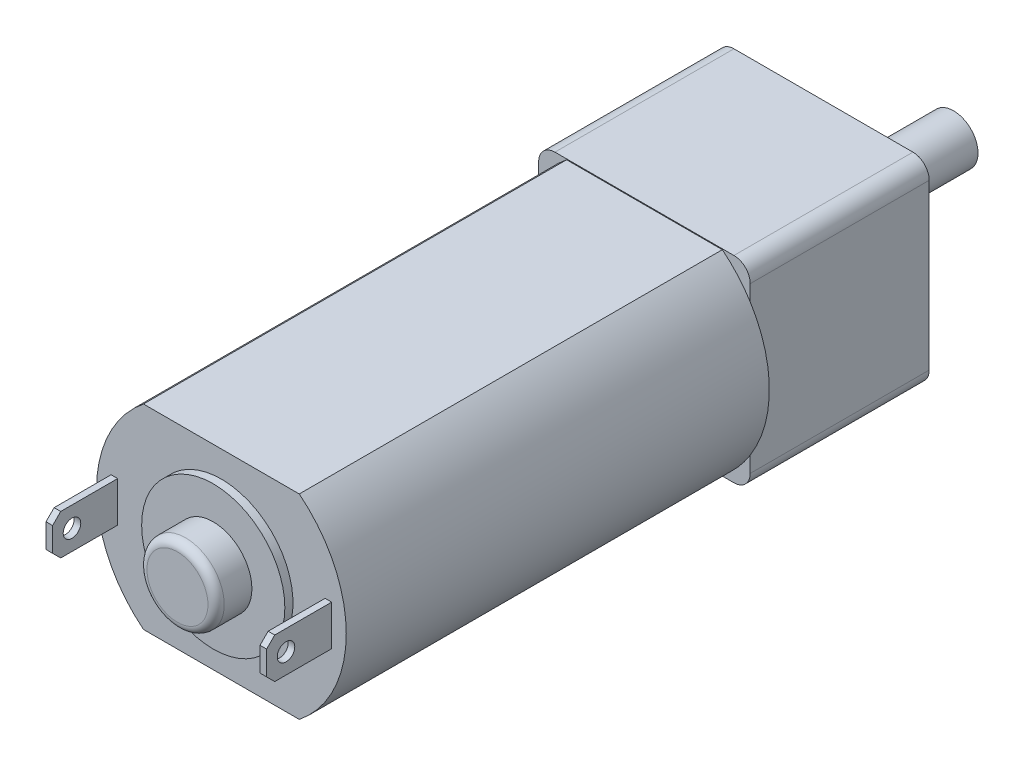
ISO-10303-21;
HEADER;
FILE_DESCRIPTION(('STEP AP214'),'2;1');
FILE_NAME('part.step','',(''),(''),'','','');
FILE_SCHEMA(('AUTOMOTIVE_DESIGN { 1 0 10303 214 1 1 1 1 }'));
ENDSEC;
DATA;
#1=APPLICATION_CONTEXT('core data for automotive mechanical design processes');
#2=APPLICATION_PROTOCOL_DEFINITION('international standard','automotive_design',2000,#1);
#3=PRODUCT_CONTEXT('',#1,'mechanical');
#4=PRODUCT('Part','Part','',(#3));
#5=PRODUCT_RELATED_PRODUCT_CATEGORY('part','',(#4));
#6=PRODUCT_DEFINITION_FORMATION('','',#4);
#7=PRODUCT_DEFINITION_CONTEXT('part definition',#1,'design');
#8=PRODUCT_DEFINITION('design','',#6,#7);
#9=PRODUCT_DEFINITION_SHAPE('','',#8);
#10=(LENGTH_UNIT() NAMED_UNIT(*) SI_UNIT(.MILLI.,.METRE.));
#11=(NAMED_UNIT(*) PLANE_ANGLE_UNIT() SI_UNIT($,.RADIAN.));
#12=(NAMED_UNIT(*) SI_UNIT($,.STERADIAN.) SOLID_ANGLE_UNIT());
#13=UNCERTAINTY_MEASURE_WITH_UNIT(LENGTH_MEASURE(1.E-05),#10,'distance_accuracy_value','');
#14=(GEOMETRIC_REPRESENTATION_CONTEXT(3) GLOBAL_UNCERTAINTY_ASSIGNED_CONTEXT((#13)) GLOBAL_UNIT_ASSIGNED_CONTEXT((#10,
#11,#12)) REPRESENTATION_CONTEXT('',''));
#15=CARTESIAN_POINT('',(0.,0.,0.));
#16=DIRECTION('',(0.,0.,1.));
#17=DIRECTION('',(1.,0.,0.));
#18=AXIS2_PLACEMENT_3D('',#15,#16,#17);
#19=CARTESIAN_POINT('',(2.39068966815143,-1.04902557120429,-22.7));
#20=DIRECTION('',(0.,1.,0.));
#21=DIRECTION('',(0.707106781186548,0.,0.707106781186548));
#22=AXIS2_PLACEMENT_3D('',#19,#20,#21);
#23=PLANE('',#22);
#24=DIRECTION('',(-1.,0.,0.));
#25=VECTOR('',#24,1.);
#26=CARTESIAN_POINT('',(2.39068966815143,-1.04902557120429,-19.));
#27=LINE('',#26,#25);
#28=CARTESIAN_POINT('',(1.07216852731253,-1.04902557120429,-19.));
#29=VERTEX_POINT('',#28);
#30=CARTESIAN_POINT('',(-1.07216852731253,-1.04902557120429,-19.));
#31=VERTEX_POINT('',#30);
#32=EDGE_CURVE('E63',#29,#31,#27,.T.);
#33=ORIENTED_EDGE('',*,*,#32,.F.);
#34=DIRECTION('',(0.,0.,-1.));
#35=VECTOR('',#34,1.);
#36=CARTESIAN_POINT('',(1.07216852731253,-1.04902557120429,-11.2));
#37=LINE('',#36,#35);
#38=CARTESIAN_POINT('',(1.07216852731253,-1.04902557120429,-12.7));
#39=VERTEX_POINT('',#38);
#40=EDGE_CURVE('E300',#39,#29,#37,.T.);
#41=ORIENTED_EDGE('',*,*,#40,.F.);
#42=DIRECTION('',(-1.,0.,0.));
#43=VECTOR('',#42,1.);
#44=CARTESIAN_POINT('',(-1.76680007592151,-1.04902557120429,-12.7));
#45=LINE('',#44,#43);
#46=CARTESIAN_POINT('',(-1.07216852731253,-1.04902557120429,-12.7));
#47=VERTEX_POINT('',#46);
#48=EDGE_CURVE('E559',#39,#47,#45,.T.);
#49=ORIENTED_EDGE('',*,*,#48,.T.);
#50=DIRECTION('',(0.,0.,1.));
#51=VECTOR('',#50,1.);
#52=CARTESIAN_POINT('',(-1.07216852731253,-1.04902557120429,-11.2));
#53=LINE('',#52,#51);
#54=EDGE_CURVE('E301',#31,#47,#53,.T.);
#55=ORIENTED_EDGE('',*,*,#54,.F.);
#56=EDGE_LOOP('',(#33,#41,#49,#55));
#57=FACE_BOUND('',#56,.T.);
#58=ADVANCED_FACE('F49',(#57),#23,.F.);
#59=CARTESIAN_POINT('',(0.,0.,-11.2));
#60=DIRECTION('',(0.,0.,-1.));
#61=DIRECTION('',(1.,0.,0.));
#62=AXIS2_PLACEMENT_3D('',#59,#60,#61);
#63=CYLINDRICAL_SURFACE('',#62,1.5);
#64=CARTESIAN_POINT('',(0.,0.,-11.2));
#65=DIRECTION('',(0.,0.,1.));
#66=DIRECTION('',(1.,0.,0.));
#67=AXIS2_PLACEMENT_3D('',#64,#65,#66);
#68=CIRCLE('',#67,1.5);
#69=CARTESIAN_POINT('',(-1.5,0.,-11.2));
#70=VERTEX_POINT('',#69);
#71=EDGE_CURVE('E308',#70,#70,#68,.T.);
#72=ORIENTED_EDGE('',*,*,#71,.F.);
#73=EDGE_LOOP('',(#72));
#74=FACE_BOUND('',#73,.T.);
#75=ORIENTED_EDGE('',*,*,#40,.T.);
#76=CARTESIAN_POINT('',(0.,0.,-19.));
#77=DIRECTION('',(0.,0.,-1.));
#78=DIRECTION('',(-1.,0.,0.));
#79=AXIS2_PLACEMENT_3D('',#76,#77,#78);
#80=CIRCLE('',#79,1.5);
#81=EDGE_CURVE('E11',#29,#31,#80,.F.);
#82=ORIENTED_EDGE('',*,*,#81,.T.);
#83=ORIENTED_EDGE('',*,*,#54,.T.);
#84=CARTESIAN_POINT('',(0.,0.,-12.7));
#85=DIRECTION('',(0.,0.,1.));
#86=DIRECTION('',(1.,0.,0.));
#87=AXIS2_PLACEMENT_3D('',#84,#85,#86);
#88=CIRCLE('',#87,1.5);
#89=EDGE_CURVE('E306',#47,#39,#88,.T.);
#90=ORIENTED_EDGE('',*,*,#89,.T.);
#91=EDGE_LOOP('',(#75,#82,#83,#90));
#92=FACE_BOUND('',#91,.T.);
#93=ADVANCED_FACE('F304',(#74,#92),#63,.T.);
#94=CARTESIAN_POINT('',(0.,0.,0.));
#95=DIRECTION('',(0.,0.,1.));
#96=DIRECTION('',(1.,0.,0.));
#97=AXIS2_PLACEMENT_3D('',#94,#95,#96);
#98=CYLINDRICAL_SURFACE('',#97,7.675);
#99=DIRECTION('',(0.,0.,1.));
#100=VECTOR('',#99,1.);
#101=CARTESIAN_POINT('',(4.78598213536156,6.,0.));
#102=LINE('',#101,#100);
#103=CARTESIAN_POINT('',(4.78598213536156,6.,0.));
#104=VERTEX_POINT('',#103);
#105=CARTESIAN_POINT('',(4.78598213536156,6.,26.));
#106=VERTEX_POINT('',#105);
#107=EDGE_CURVE('E476',#104,#106,#102,.T.);
#108=ORIENTED_EDGE('',*,*,#107,.T.);
#109=CARTESIAN_POINT('',(0.,0.,26.));
#110=DIRECTION('',(0.,0.,1.));
#111=DIRECTION('',(1.,0.,0.));
#112=AXIS2_PLACEMENT_3D('',#109,#110,#111);
#113=CIRCLE('',#112,7.675);
#114=CARTESIAN_POINT('',(4.78598213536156,-6.,26.));
#115=VERTEX_POINT('',#114);
#116=EDGE_CURVE('E471',#115,#106,#113,.T.);
#117=ORIENTED_EDGE('',*,*,#116,.F.);
#118=DIRECTION('',(0.,0.,1.));
#119=VECTOR('',#118,1.);
#120=CARTESIAN_POINT('',(4.78598213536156,-6.,0.));
#121=LINE('',#120,#119);
#122=CARTESIAN_POINT('',(4.78598213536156,-6.,0.));
#123=VERTEX_POINT('',#122);
#124=EDGE_CURVE('E70',#123,#115,#121,.T.);
#125=ORIENTED_EDGE('',*,*,#124,.F.);
#126=CARTESIAN_POINT('',(0.,0.,0.));
#127=DIRECTION('',(0.,0.,1.));
#128=DIRECTION('',(1.,0.,0.));
#129=AXIS2_PLACEMENT_3D('',#126,#127,#128);
#130=CIRCLE('',#129,7.675);
#131=CARTESIAN_POINT('',(6.5,-4.08113035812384,0.));
#132=VERTEX_POINT('',#131);
#133=EDGE_CURVE('E452',#123,#132,#130,.T.);
#134=ORIENTED_EDGE('',*,*,#133,.T.);
#135=CARTESIAN_POINT('',(6.5,4.08113035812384,0.));
#136=VERTEX_POINT('',#135);
#137=EDGE_CURVE('E458',#132,#136,#130,.T.);
#138=ORIENTED_EDGE('',*,*,#137,.T.);
#139=EDGE_CURVE('E446',#136,#104,#130,.T.);
#140=ORIENTED_EDGE('',*,*,#139,.T.);
#141=EDGE_LOOP('',(#108,#117,#125,#134,#138,#140));
#142=FACE_BOUND('',#141,.T.);
#143=ADVANCED_FACE('F589',(#142),#98,.T.);
#144=DIRECTION('',(0.,0.,1.));
#145=VECTOR('',#144,1.);
#146=CARTESIAN_POINT('',(-4.78598213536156,6.,0.));
#147=LINE('',#146,#145);
#148=CARTESIAN_POINT('',(-4.78598213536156,6.,0.));
#149=VERTEX_POINT('',#148);
#150=CARTESIAN_POINT('',(-4.78598213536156,6.,26.));
#151=VERTEX_POINT('',#150);
#152=EDGE_CURVE('E1087',#149,#151,#147,.T.);
#153=ORIENTED_EDGE('',*,*,#152,.F.);
#154=CARTESIAN_POINT('',(-6.5,4.08113035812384,0.));
#155=VERTEX_POINT('',#154);
#156=EDGE_CURVE('E450',#149,#155,#130,.T.);
#157=ORIENTED_EDGE('',*,*,#156,.T.);
#158=CARTESIAN_POINT('',(-6.5,-4.08113035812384,0.));
#159=VERTEX_POINT('',#158);
#160=EDGE_CURVE('E453',#155,#159,#130,.T.);
#161=ORIENTED_EDGE('',*,*,#160,.T.);
#162=CARTESIAN_POINT('',(-4.78598213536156,-6.,0.));
#163=VERTEX_POINT('',#162);
#164=EDGE_CURVE('E461',#159,#163,#130,.T.);
#165=ORIENTED_EDGE('',*,*,#164,.T.);
#166=DIRECTION('',(0.,0.,1.));
#167=VECTOR('',#166,1.);
#168=CARTESIAN_POINT('',(-4.78598213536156,-6.,0.));
#169=LINE('',#168,#167);
#170=CARTESIAN_POINT('',(-4.78598213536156,-6.,26.));
#171=VERTEX_POINT('',#170);
#172=EDGE_CURVE('E1093',#163,#171,#169,.T.);
#173=ORIENTED_EDGE('',*,*,#172,.T.);
#174=EDGE_CURVE('E468',#151,#171,#113,.T.);
#175=ORIENTED_EDGE('',*,*,#174,.F.);
#176=EDGE_LOOP('',(#153,#157,#161,#165,#173,#175));
#177=FACE_BOUND('',#176,.T.);
#178=ADVANCED_FACE('F888',(#177),#98,.T.);
#179=CARTESIAN_POINT('',(0.,0.,26.));
#180=DIRECTION('',(0.,0.,1.));
#181=DIRECTION('',(0.707106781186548,0.707106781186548,0.));
#182=AXIS2_PLACEMENT_3D('',#179,#180,#181);
#183=PLANE('',#182);
#184=DIRECTION('',(1.,0.,0.));
#185=VECTOR('',#184,1.);
#186=CARTESIAN_POINT('',(0.,6.,26.));
#187=LINE('',#186,#185);
#188=EDGE_CURVE('E1090',#151,#106,#187,.T.);
#189=ORIENTED_EDGE('',*,*,#188,.F.);
#190=ORIENTED_EDGE('',*,*,#174,.T.);
#191=DIRECTION('',(1.,0.,0.));
#192=VECTOR('',#191,1.);
#193=CARTESIAN_POINT('',(0.,-6.,26.));
#194=LINE('',#193,#192);
#195=EDGE_CURVE('E302',#171,#115,#194,.T.);
#196=ORIENTED_EDGE('',*,*,#195,.T.);
#197=ORIENTED_EDGE('',*,*,#116,.T.);
#198=EDGE_LOOP('',(#189,#190,#196,#197));
#199=FACE_BOUND('',#198,.T.);
#200=DIRECTION('',(0.,-1.,0.));
#201=VECTOR('',#200,1.);
#202=CARTESIAN_POINT('',(6.77850761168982,0.619842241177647,26.));
#203=LINE('',#202,#201);
#204=CARTESIAN_POINT('',(6.77850761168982,1.23968448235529,26.));
#205=VERTEX_POINT('',#204);
#206=CARTESIAN_POINT('',(6.77850761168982,-1.23968448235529,26.));
#207=VERTEX_POINT('',#206);
#208=EDGE_CURVE('E362',#205,#207,#203,.T.);
#209=ORIENTED_EDGE('',*,*,#208,.T.);
#210=DIRECTION('',(-1.,0.,0.));
#211=VECTOR('',#210,1.);
#212=CARTESIAN_POINT('',(3.38925380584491,-1.23968448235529,26.));
#213=LINE('',#212,#211);
#214=CARTESIAN_POINT('',(6.37418759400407,-1.23968448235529,26.));
#215=VERTEX_POINT('',#214);
#216=EDGE_CURVE('E365',#207,#215,#213,.T.);
#217=ORIENTED_EDGE('',*,*,#216,.T.);
#218=DIRECTION('',(0.,1.,0.));
#219=VECTOR('',#218,1.);
#220=CARTESIAN_POINT('',(6.37418759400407,-0.619842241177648,26.));
#221=LINE('',#220,#219);
#222=CARTESIAN_POINT('',(6.37418759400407,1.23968448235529,26.));
#223=VERTEX_POINT('',#222);
#224=EDGE_CURVE('E346',#215,#223,#221,.T.);
#225=ORIENTED_EDGE('',*,*,#224,.T.);
#226=DIRECTION('',(1.,0.,0.));
#227=VECTOR('',#226,1.);
#228=CARTESIAN_POINT('',(3.18709379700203,1.23968448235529,26.));
#229=LINE('',#228,#227);
#230=EDGE_CURVE('E344',#223,#205,#229,.T.);
#231=ORIENTED_EDGE('',*,*,#230,.T.);
#232=EDGE_LOOP('',(#209,#217,#225,#231));
#233=FACE_BOUND('',#232,.T.);
#234=DIRECTION('',(0.,1.,0.));
#235=VECTOR('',#234,1.);
#236=CARTESIAN_POINT('',(-6.77850761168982,0.619842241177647,26.));
#237=LINE('',#236,#235);
#238=CARTESIAN_POINT('',(-6.77850761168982,-1.23968448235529,26.));
#239=VERTEX_POINT('',#238);
#240=CARTESIAN_POINT('',(-6.77850761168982,1.23968448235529,26.));
#241=VERTEX_POINT('',#240);
#242=EDGE_CURVE('E347',#239,#241,#237,.T.);
#243=ORIENTED_EDGE('',*,*,#242,.T.);
#244=DIRECTION('',(1.,0.,0.));
#245=VECTOR('',#244,1.);
#246=CARTESIAN_POINT('',(-3.18709379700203,1.23968448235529,26.));
#247=LINE('',#246,#245);
#248=CARTESIAN_POINT('',(-6.37418759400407,1.23968448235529,26.));
#249=VERTEX_POINT('',#248);
#250=EDGE_CURVE('E409',#241,#249,#247,.T.);
#251=ORIENTED_EDGE('',*,*,#250,.T.);
#252=DIRECTION('',(0.,-1.,0.));
#253=VECTOR('',#252,1.);
#254=CARTESIAN_POINT('',(-6.37418759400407,-0.619842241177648,26.));
#255=LINE('',#254,#253);
#256=CARTESIAN_POINT('',(-6.37418759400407,-1.23968448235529,26.));
#257=VERTEX_POINT('',#256);
#258=EDGE_CURVE('E436',#249,#257,#255,.T.);
#259=ORIENTED_EDGE('',*,*,#258,.T.);
#260=DIRECTION('',(-1.,0.,0.));
#261=VECTOR('',#260,1.);
#262=CARTESIAN_POINT('',(-3.38925380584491,-1.23968448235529,26.));
#263=LINE('',#262,#261);
#264=EDGE_CURVE('E440',#257,#239,#263,.T.);
#265=ORIENTED_EDGE('',*,*,#264,.T.);
#266=EDGE_LOOP('',(#243,#251,#259,#265));
#267=FACE_BOUND('',#266,.T.);
#268=CARTESIAN_POINT('',(0.,0.,26.));
#269=DIRECTION('',(0.,0.,-1.));
#270=DIRECTION('',(-1.,0.,0.));
#271=AXIS2_PLACEMENT_3D('',#268,#269,#270);
#272=CIRCLE('',#271,4.4);
#273=CARTESIAN_POINT('',(-4.4,0.,26.));
#274=VERTEX_POINT('',#273);
#275=EDGE_CURVE('E443',#274,#274,#272,.T.);
#276=ORIENTED_EDGE('',*,*,#275,.T.);
#277=EDGE_LOOP('',(#276));
#278=FACE_BOUND('',#277,.T.);
#279=ADVANCED_FACE('F51',(#199,#233,#267,#278),#183,.T.);
#280=CARTESIAN_POINT('',(0.,4.375,-5.69956969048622));
#281=DIRECTION('',(0.,0.,-1.));
#282=DIRECTION('',(-1.,0.,0.));
#283=AXIS2_PLACEMENT_3D('',#280,#281,#282);
#284=CONICAL_SURFACE('',#283,0.5,1.02974425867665);
#285=CARTESIAN_POINT('',(0.,4.375,-6.));
#286=DIRECTION('',(0.,0.,-1.));
#287=DIRECTION('',(-1.,0.,0.));
#288=AXIS2_PLACEMENT_3D('',#285,#286,#287);
#289=CIRCLE('',#288,1.);
#290=CARTESIAN_POINT('',(-1.,4.375,-6.));
#291=VERTEX_POINT('',#290);
#292=EDGE_CURVE('E57',#291,#291,#289,.T.);
#293=ORIENTED_EDGE('',*,*,#292,.T.);
#294=EDGE_LOOP('',(#293));
#295=FACE_BOUND('',#294,.T.);
#296=CARTESIAN_POINT('',(0.,4.375,-5.39913938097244));
#297=VERTEX_POINT('',#296);
#298=VERTEX_LOOP('',#297);
#299=FACE_BOUND('',#298,.T.);
#300=ADVANCED_FACE('F806',(#295,#299),#284,.F.);
#301=CARTESIAN_POINT('',(0.,4.375,-8.5));
#302=DIRECTION('',(0.,0.,-1.));
#303=DIRECTION('',(-1.,0.,0.));
#304=AXIS2_PLACEMENT_3D('',#301,#302,#303);
#305=CYLINDRICAL_SURFACE('',#304,1.);
#306=CARTESIAN_POINT('',(0.,4.375,-11.));
#307=DIRECTION('',(0.,0.,1.));
#308=DIRECTION('',(-1.,0.,0.));
#309=AXIS2_PLACEMENT_3D('',#306,#307,#308);
#310=CIRCLE('',#309,1.);
#311=CARTESIAN_POINT('',(-1.,4.375,-11.));
#312=VERTEX_POINT('',#311);
#313=EDGE_CURVE('E481',#312,#312,#310,.T.);
#314=ORIENTED_EDGE('',*,*,#313,.F.);
#315=EDGE_LOOP('',(#314));
#316=FACE_BOUND('',#315,.T.);
#317=ORIENTED_EDGE('',*,*,#292,.F.);
#318=EDGE_LOOP('',(#317));
#319=FACE_BOUND('',#318,.T.);
#320=ADVANCED_FACE('F800',(#316,#319),#305,.F.);
#321=CARTESIAN_POINT('',(0.,-4.375,-5.69956969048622));
#322=DIRECTION('',(0.,0.,-1.));
#323=DIRECTION('',(-1.,0.,0.));
#324=AXIS2_PLACEMENT_3D('',#321,#322,#323);
#325=CONICAL_SURFACE('',#324,0.5,1.02974425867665);
#326=CARTESIAN_POINT('',(0.,-4.375,-6.));
#327=DIRECTION('',(0.,0.,-1.));
#328=DIRECTION('',(-1.,0.,0.));
#329=AXIS2_PLACEMENT_3D('',#326,#327,#328);
#330=CIRCLE('',#329,1.);
#331=CARTESIAN_POINT('',(-1.,-4.375,-6.));
#332=VERTEX_POINT('',#331);
#333=EDGE_CURVE('E480',#332,#332,#330,.T.);
#334=ORIENTED_EDGE('',*,*,#333,.T.);
#335=EDGE_LOOP('',(#334));
#336=FACE_BOUND('',#335,.T.);
#337=CARTESIAN_POINT('',(0.,-4.375,-5.39913938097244));
#338=VERTEX_POINT('',#337);
#339=VERTEX_LOOP('',#338);
#340=FACE_BOUND('',#339,.T.);
#341=ADVANCED_FACE('F791',(#336,#340),#325,.F.);
#342=CARTESIAN_POINT('',(0.,-4.375,-8.5));
#343=DIRECTION('',(0.,0.,-1.));
#344=DIRECTION('',(-1.,0.,0.));
#345=AXIS2_PLACEMENT_3D('',#342,#343,#344);
#346=CYLINDRICAL_SURFACE('',#345,1.);
#347=CARTESIAN_POINT('',(0.,-4.375,-11.));
#348=DIRECTION('',(0.,0.,1.));
#349=DIRECTION('',(-1.,0.,0.));
#350=AXIS2_PLACEMENT_3D('',#347,#348,#349);
#351=CIRCLE('',#350,1.);
#352=CARTESIAN_POINT('',(-1.,-4.375,-11.));
#353=VERTEX_POINT('',#352);
#354=EDGE_CURVE('E485',#353,#353,#351,.T.);
#355=ORIENTED_EDGE('',*,*,#354,.F.);
#356=EDGE_LOOP('',(#355));
#357=FACE_BOUND('',#356,.T.);
#358=ORIENTED_EDGE('',*,*,#333,.F.);
#359=EDGE_LOOP('',(#358));
#360=FACE_BOUND('',#359,.T.);
#361=ADVANCED_FACE('F779',(#357,#360),#346,.F.);
#362=CARTESIAN_POINT('',(4.5,4.05,-11.));
#363=DIRECTION('',(0.,0.,1.));
#364=DIRECTION('',(1.,0.,0.));
#365=AXIS2_PLACEMENT_3D('',#362,#363,#364);
#366=CYLINDRICAL_SURFACE('',#365,1.15);
#367=CARTESIAN_POINT('',(4.5,4.05,-10.9));
#368=DIRECTION('',(0.,0.,1.));
#369=DIRECTION('',(1.,0.,0.));
#370=AXIS2_PLACEMENT_3D('',#367,#368,#369);
#371=CIRCLE('',#370,1.15);
#372=CARTESIAN_POINT('',(3.35,4.05,-10.9));
#373=VERTEX_POINT('',#372);
#374=EDGE_CURVE('E488',#373,#373,#371,.T.);
#375=ORIENTED_EDGE('',*,*,#374,.T.);
#376=EDGE_LOOP('',(#375));
#377=FACE_BOUND('',#376,.T.);
#378=CARTESIAN_POINT('',(4.5,4.05,-11.));
#379=DIRECTION('',(0.,0.,1.));
#380=DIRECTION('',(1.,0.,0.));
#381=AXIS2_PLACEMENT_3D('',#378,#379,#380);
#382=CIRCLE('',#381,1.15);
#383=CARTESIAN_POINT('',(3.35,4.05,-11.));
#384=VERTEX_POINT('',#383);
#385=EDGE_CURVE('E491',#384,#384,#382,.T.);
#386=ORIENTED_EDGE('',*,*,#385,.F.);
#387=EDGE_LOOP('',(#386));
#388=FACE_BOUND('',#387,.T.);
#389=ADVANCED_FACE('F773',(#377,#388),#366,.F.);
#390=CARTESIAN_POINT('',(4.5,4.05,-10.9));
#391=DIRECTION('',(0.,0.,1.));
#392=DIRECTION('',(0.707106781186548,0.707106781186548,0.));
#393=AXIS2_PLACEMENT_3D('',#390,#391,#392);
#394=PLANE('',#393);
#395=ORIENTED_EDGE('',*,*,#374,.F.);
#396=EDGE_LOOP('',(#395));
#397=FACE_BOUND('',#396,.T.);
#398=ADVANCED_FACE('F762',(#397),#394,.F.);
#399=CARTESIAN_POINT('',(-4.5,-4.05,-11.));
#400=DIRECTION('',(0.,0.,1.));
#401=DIRECTION('',(1.,0.,0.));
#402=AXIS2_PLACEMENT_3D('',#399,#400,#401);
#403=CYLINDRICAL_SURFACE('',#402,1.15);
#404=CARTESIAN_POINT('',(-4.5,-4.05,-10.9));
#405=DIRECTION('',(0.,0.,1.));
#406=DIRECTION('',(1.,0.,0.));
#407=AXIS2_PLACEMENT_3D('',#404,#405,#406);
#408=CIRCLE('',#407,1.15);
#409=CARTESIAN_POINT('',(-5.65,-4.05,-10.9));
#410=VERTEX_POINT('',#409);
#411=EDGE_CURVE('E494',#410,#410,#408,.T.);
#412=ORIENTED_EDGE('',*,*,#411,.T.);
#413=EDGE_LOOP('',(#412));
#414=FACE_BOUND('',#413,.T.);
#415=CARTESIAN_POINT('',(-4.5,-4.05,-11.));
#416=DIRECTION('',(0.,0.,1.));
#417=DIRECTION('',(1.,0.,0.));
#418=AXIS2_PLACEMENT_3D('',#415,#416,#417);
#419=CIRCLE('',#418,1.15);
#420=CARTESIAN_POINT('',(-5.65,-4.05,-11.));
#421=VERTEX_POINT('',#420);
#422=EDGE_CURVE('E497',#421,#421,#419,.T.);
#423=ORIENTED_EDGE('',*,*,#422,.F.);
#424=EDGE_LOOP('',(#423));
#425=FACE_BOUND('',#424,.T.);
#426=ADVANCED_FACE('F755',(#414,#425),#403,.F.);
#427=CARTESIAN_POINT('',(-4.5,-4.05,-10.9));
#428=DIRECTION('',(0.,0.,1.));
#429=DIRECTION('',(0.707106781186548,0.707106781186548,0.));
#430=AXIS2_PLACEMENT_3D('',#427,#428,#429);
#431=PLANE('',#430);
#432=ORIENTED_EDGE('',*,*,#411,.F.);
#433=EDGE_LOOP('',(#432));
#434=FACE_BOUND('',#433,.T.);
#435=ADVANCED_FACE('F761',(#434),#431,.F.);
#436=CARTESIAN_POINT('',(5.5,-5.05,0.));
#437=DIRECTION('',(0.,0.,-1.));
#438=DIRECTION('',(0.707106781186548,-0.707106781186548,0.));
#439=AXIS2_PLACEMENT_3D('',#436,#437,#438);
#440=CYLINDRICAL_SURFACE('',#439,1.);
#441=CARTESIAN_POINT('',(5.5,-5.05,-11.));
#442=DIRECTION('',(0.,0.,1.));
#443=DIRECTION('',(0.707106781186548,-0.707106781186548,0.));
#444=AXIS2_PLACEMENT_3D('',#441,#442,#443);
#445=CIRCLE('',#444,1.);
#446=CARTESIAN_POINT('',(5.5,-6.05,-11.));
#447=VERTEX_POINT('',#446);
#448=CARTESIAN_POINT('',(6.5,-5.05,-11.));
#449=VERTEX_POINT('',#448);
#450=EDGE_CURVE('E500',#447,#449,#445,.T.);
#451=ORIENTED_EDGE('',*,*,#450,.T.);
#452=DIRECTION('',(0.,0.,1.));
#453=VECTOR('',#452,1.);
#454=CARTESIAN_POINT('',(6.5,-5.05,0.));
#455=LINE('',#454,#453);
#456=CARTESIAN_POINT('',(6.5,-5.05,0.));
#457=VERTEX_POINT('',#456);
#458=EDGE_CURVE('E506',#449,#457,#455,.T.);
#459=ORIENTED_EDGE('',*,*,#458,.T.);
#460=CARTESIAN_POINT('',(5.5,-5.05,0.));
#461=DIRECTION('',(0.,0.,-1.));
#462=DIRECTION('',(0.707106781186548,-0.707106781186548,0.));
#463=AXIS2_PLACEMENT_3D('',#460,#461,#462);
#464=CIRCLE('',#463,1.);
#465=CARTESIAN_POINT('',(5.5,-6.05,0.));
#466=VERTEX_POINT('',#465);
#467=EDGE_CURVE('E509',#457,#466,#464,.T.);
#468=ORIENTED_EDGE('',*,*,#467,.T.);
#469=DIRECTION('',(0.,0.,-1.));
#470=VECTOR('',#469,1.);
#471=CARTESIAN_POINT('',(5.5,-6.05,0.));
#472=LINE('',#471,#470);
#473=EDGE_CURVE('E512',#466,#447,#472,.T.);
#474=ORIENTED_EDGE('',*,*,#473,.T.);
#475=EDGE_LOOP('',(#451,#459,#468,#474));
#476=FACE_BOUND('',#475,.T.);
#477=ADVANCED_FACE('F847',(#476),#440,.T.);
#478=CARTESIAN_POINT('',(6.5,-6.05,0.));
#479=DIRECTION('',(0.,-1.,0.));
#480=DIRECTION('',(0.707106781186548,0.,0.707106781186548));
#481=AXIS2_PLACEMENT_3D('',#478,#479,#480);
#482=PLANE('',#481);
#483=ORIENTED_EDGE('',*,*,#473,.F.);
#484=DIRECTION('',(-1.,0.,0.));
#485=VECTOR('',#484,1.);
#486=CARTESIAN_POINT('',(6.5,-6.05,0.));
#487=LINE('',#486,#485);
#488=CARTESIAN_POINT('',(-5.5,-6.05,0.));
#489=VERTEX_POINT('',#488);
#490=EDGE_CURVE('E514',#466,#489,#487,.T.);
#491=ORIENTED_EDGE('',*,*,#490,.T.);
#492=DIRECTION('',(0.,0.,1.));
#493=VECTOR('',#492,1.);
#494=CARTESIAN_POINT('',(-5.5,-6.05,0.));
#495=LINE('',#494,#493);
#496=CARTESIAN_POINT('',(-5.5,-6.05,-11.));
#497=VERTEX_POINT('',#496);
#498=EDGE_CURVE('E517',#497,#489,#495,.T.);
#499=ORIENTED_EDGE('',*,*,#498,.F.);
#500=DIRECTION('',(-1.,0.,0.));
#501=VECTOR('',#500,1.);
#502=CARTESIAN_POINT('',(6.5,-6.05,-11.));
#503=LINE('',#502,#501);
#504=EDGE_CURVE('E503',#447,#497,#503,.T.);
#505=ORIENTED_EDGE('',*,*,#504,.F.);
#506=EDGE_LOOP('',(#483,#491,#499,#505));
#507=FACE_BOUND('',#506,.T.);
#508=ADVANCED_FACE('F958',(#507),#482,.T.);
#509=CARTESIAN_POINT('',(0.,0.,0.));
#510=DIRECTION('',(0.,0.,1.));
#511=DIRECTION('',(0.707106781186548,0.707106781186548,0.));
#512=AXIS2_PLACEMENT_3D('',#509,#510,#511);
#513=PLANE('',#512);
#514=ORIENTED_EDGE('',*,*,#133,.F.);
#515=DIRECTION('',(1.,0.,0.));
#516=VECTOR('',#515,1.);
#517=CARTESIAN_POINT('',(0.,-6.,0.));
#518=LINE('',#517,#516);
#519=EDGE_CURVE('E1091',#163,#123,#518,.T.);
#520=ORIENTED_EDGE('',*,*,#519,.F.);
#521=ORIENTED_EDGE('',*,*,#164,.F.);
#522=DIRECTION('',(0.,1.,0.));
#523=VECTOR('',#522,1.);
#524=CARTESIAN_POINT('',(-6.5,-6.05,0.));
#525=LINE('',#524,#523);
#526=CARTESIAN_POINT('',(-6.5,-5.05,0.));
#527=VERTEX_POINT('',#526);
#528=EDGE_CURVE('E527',#527,#159,#525,.T.);
#529=ORIENTED_EDGE('',*,*,#528,.F.);
#530=CARTESIAN_POINT('',(-5.5,-5.05,0.));
#531=DIRECTION('',(0.,0.,-1.));
#532=DIRECTION('',(-0.707106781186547,-0.707106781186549,0.));
#533=AXIS2_PLACEMENT_3D('',#530,#531,#532);
#534=CIRCLE('',#533,1.);
#535=EDGE_CURVE('E521',#489,#527,#534,.T.);
#536=ORIENTED_EDGE('',*,*,#535,.F.);
#537=ORIENTED_EDGE('',*,*,#490,.F.);
#538=ORIENTED_EDGE('',*,*,#467,.F.);
#539=DIRECTION('',(0.,-1.,0.));
#540=VECTOR('',#539,1.);
#541=CARTESIAN_POINT('',(6.5,6.05,0.));
#542=LINE('',#541,#540);
#543=EDGE_CURVE('E484',#132,#457,#542,.T.);
#544=ORIENTED_EDGE('',*,*,#543,.F.);
#545=EDGE_LOOP('',(#514,#520,#521,#529,#536,#537,#538,#544));
#546=FACE_BOUND('',#545,.T.);
#547=ADVANCED_FACE('F948',(#546),#513,.T.);
#548=CARTESIAN_POINT('',(5.5,5.05,0.));
#549=DIRECTION('',(0.,0.,-1.));
#550=DIRECTION('',(0.707106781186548,0.707106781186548,0.));
#551=AXIS2_PLACEMENT_3D('',#548,#549,#550);
#552=CYLINDRICAL_SURFACE('',#551,1.);
#553=CARTESIAN_POINT('',(5.5,5.05,-11.));
#554=DIRECTION('',(0.,0.,1.));
#555=DIRECTION('',(0.707106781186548,0.707106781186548,0.));
#556=AXIS2_PLACEMENT_3D('',#553,#554,#555);
#557=CIRCLE('',#556,1.);
#558=CARTESIAN_POINT('',(6.5,5.05,-11.));
#559=VERTEX_POINT('',#558);
#560=CARTESIAN_POINT('',(5.5,6.05,-11.));
#561=VERTEX_POINT('',#560);
#562=EDGE_CURVE('E516',#559,#561,#557,.T.);
#563=ORIENTED_EDGE('',*,*,#562,.T.);
#564=DIRECTION('',(0.,0.,1.));
#565=VECTOR('',#564,1.);
#566=CARTESIAN_POINT('',(5.5,6.05,0.));
#567=LINE('',#566,#565);
#568=CARTESIAN_POINT('',(5.5,6.05,0.));
#569=VERTEX_POINT('',#568);
#570=EDGE_CURVE('E536',#561,#569,#567,.T.);
#571=ORIENTED_EDGE('',*,*,#570,.T.);
#572=CARTESIAN_POINT('',(5.5,5.05,0.));
#573=DIRECTION('',(0.,0.,-1.));
#574=DIRECTION('',(0.707106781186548,0.707106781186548,0.));
#575=AXIS2_PLACEMENT_3D('',#572,#573,#574);
#576=CIRCLE('',#575,1.);
#577=CARTESIAN_POINT('',(6.5,5.05,0.));
#578=VERTEX_POINT('',#577);
#579=EDGE_CURVE('E539',#569,#578,#576,.T.);
#580=ORIENTED_EDGE('',*,*,#579,.T.);
#581=DIRECTION('',(0.,0.,-1.));
#582=VECTOR('',#581,1.);
#583=CARTESIAN_POINT('',(6.5,5.05,0.));
#584=LINE('',#583,#582);
#585=EDGE_CURVE('E542',#578,#559,#584,.T.);
#586=ORIENTED_EDGE('',*,*,#585,.T.);
#587=EDGE_LOOP('',(#563,#571,#580,#586));
#588=FACE_BOUND('',#587,.T.);
#589=ADVANCED_FACE('F942',(#588),#552,.T.);
#590=CARTESIAN_POINT('',(0.,0.,0.));
#591=DIRECTION('',(0.,0.,1.));
#592=DIRECTION('',(0.707106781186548,0.707106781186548,0.));
#593=AXIS2_PLACEMENT_3D('',#590,#591,#592);
#594=PLANE('',#593);
#595=ORIENTED_EDGE('',*,*,#156,.F.);
#596=DIRECTION('',(1.,0.,0.));
#597=VECTOR('',#596,1.);
#598=CARTESIAN_POINT('',(0.,6.,0.));
#599=LINE('',#598,#597);
#600=EDGE_CURVE('E1107',#149,#104,#599,.T.);
#601=ORIENTED_EDGE('',*,*,#600,.T.);
#602=ORIENTED_EDGE('',*,*,#139,.F.);
#603=DIRECTION('',(0.,-1.,0.));
#604=VECTOR('',#603,1.);
#605=CARTESIAN_POINT('',(6.5,6.05,0.));
#606=LINE('',#605,#604);
#607=EDGE_CURVE('E319',#578,#136,#606,.T.);
#608=ORIENTED_EDGE('',*,*,#607,.F.);
#609=ORIENTED_EDGE('',*,*,#579,.F.);
#610=DIRECTION('',(1.,0.,0.));
#611=VECTOR('',#610,1.);
#612=CARTESIAN_POINT('',(-6.5,6.05,0.));
#613=LINE('',#612,#611);
#614=CARTESIAN_POINT('',(-5.5,6.05,0.));
#615=VERTEX_POINT('',#614);
#616=EDGE_CURVE('E544',#615,#569,#613,.T.);
#617=ORIENTED_EDGE('',*,*,#616,.F.);
#618=CARTESIAN_POINT('',(-5.5,5.05,0.));
#619=DIRECTION('',(0.,0.,-1.));
#620=DIRECTION('',(-0.707106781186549,0.707106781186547,0.));
#621=AXIS2_PLACEMENT_3D('',#618,#619,#620);
#622=CIRCLE('',#621,1.);
#623=CARTESIAN_POINT('',(-6.5,5.05,0.));
#624=VERTEX_POINT('',#623);
#625=EDGE_CURVE('E546',#624,#615,#622,.T.);
#626=ORIENTED_EDGE('',*,*,#625,.F.);
#627=DIRECTION('',(0.,1.,0.));
#628=VECTOR('',#627,1.);
#629=CARTESIAN_POINT('',(-6.5,-6.05,0.));
#630=LINE('',#629,#628);
#631=EDGE_CURVE('E552',#155,#624,#630,.T.);
#632=ORIENTED_EDGE('',*,*,#631,.F.);
#633=EDGE_LOOP('',(#595,#601,#602,#608,#609,#617,#626,#632));
#634=FACE_BOUND('',#633,.T.);
#635=ADVANCED_FACE('F934',(#634),#594,.T.);
#636=CARTESIAN_POINT('',(-6.5,6.05,0.));
#637=DIRECTION('',(0.,1.,0.));
#638=DIRECTION('',(0.707106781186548,0.,0.707106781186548));
#639=AXIS2_PLACEMENT_3D('',#636,#637,#638);
#640=PLANE('',#639);
#641=ORIENTED_EDGE('',*,*,#570,.F.);
#642=DIRECTION('',(1.,0.,0.));
#643=VECTOR('',#642,1.);
#644=CARTESIAN_POINT('',(-6.5,6.05,-11.));
#645=LINE('',#644,#643);
#646=CARTESIAN_POINT('',(-5.5,6.05,-11.));
#647=VERTEX_POINT('',#646);
#648=EDGE_CURVE('E327',#647,#561,#645,.T.);
#649=ORIENTED_EDGE('',*,*,#648,.F.);
#650=DIRECTION('',(0.,0.,-1.));
#651=VECTOR('',#650,1.);
#652=CARTESIAN_POINT('',(-5.5,6.05,0.));
#653=LINE('',#652,#651);
#654=EDGE_CURVE('E549',#615,#647,#653,.T.);
#655=ORIENTED_EDGE('',*,*,#654,.F.);
#656=ORIENTED_EDGE('',*,*,#616,.T.);
#657=EDGE_LOOP('',(#641,#649,#655,#656));
#658=FACE_BOUND('',#657,.T.);
#659=ADVANCED_FACE('F921',(#658),#640,.T.);
#660=CARTESIAN_POINT('',(-5.5,-5.05,0.));
#661=DIRECTION('',(0.,0.,-1.));
#662=DIRECTION('',(-0.707106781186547,-0.707106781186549,0.));
#663=AXIS2_PLACEMENT_3D('',#660,#661,#662);
#664=CYLINDRICAL_SURFACE('',#663,1.);
#665=CARTESIAN_POINT('',(-5.5,-5.05,-11.));
#666=DIRECTION('',(0.,0.,1.));
#667=DIRECTION('',(-0.707106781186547,-0.707106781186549,0.));
#668=AXIS2_PLACEMENT_3D('',#665,#666,#667);
#669=CIRCLE('',#668,1.);
#670=CARTESIAN_POINT('',(-6.5,-5.05,-11.));
#671=VERTEX_POINT('',#670);
#672=EDGE_CURVE('E520',#671,#497,#669,.T.);
#673=ORIENTED_EDGE('',*,*,#672,.T.);
#674=ORIENTED_EDGE('',*,*,#498,.T.);
#675=ORIENTED_EDGE('',*,*,#535,.T.);
#676=DIRECTION('',(0.,0.,-1.));
#677=VECTOR('',#676,1.);
#678=CARTESIAN_POINT('',(-6.5,-5.05,0.));
#679=LINE('',#678,#677);
#680=EDGE_CURVE('E530',#527,#671,#679,.T.);
#681=ORIENTED_EDGE('',*,*,#680,.T.);
#682=EDGE_LOOP('',(#673,#674,#675,#681));
#683=FACE_BOUND('',#682,.T.);
#684=ADVANCED_FACE('F915',(#683),#664,.T.);
#685=CARTESIAN_POINT('',(-6.5,-6.05,0.));
#686=DIRECTION('',(-1.,0.,0.));
#687=DIRECTION('',(0.,0.707106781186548,0.707106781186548));
#688=AXIS2_PLACEMENT_3D('',#685,#686,#687);
#689=PLANE('',#688);
#690=ORIENTED_EDGE('',*,*,#680,.F.);
#691=ORIENTED_EDGE('',*,*,#528,.T.);
#692=EDGE_CURVE('E531',#159,#155,#630,.T.);
#693=ORIENTED_EDGE('',*,*,#692,.T.);
#694=ORIENTED_EDGE('',*,*,#631,.T.);
#695=DIRECTION('',(0.,0.,1.));
#696=VECTOR('',#695,1.);
#697=CARTESIAN_POINT('',(-6.5,5.05,0.));
#698=LINE('',#697,#696);
#699=CARTESIAN_POINT('',(-6.5,5.05,-11.));
#700=VERTEX_POINT('',#699);
#701=EDGE_CURVE('E548',#700,#624,#698,.T.);
#702=ORIENTED_EDGE('',*,*,#701,.F.);
#703=DIRECTION('',(0.,1.,0.));
#704=VECTOR('',#703,1.);
#705=CARTESIAN_POINT('',(-6.5,-6.05,-11.));
#706=LINE('',#705,#704);
#707=EDGE_CURVE('E523',#671,#700,#706,.T.);
#708=ORIENTED_EDGE('',*,*,#707,.F.);
#709=EDGE_LOOP('',(#690,#691,#693,#694,#702,#708));
#710=FACE_BOUND('',#709,.T.);
#711=ADVANCED_FACE('F581',(#710),#689,.T.);
#712=CARTESIAN_POINT('',(-5.5,5.05,0.));
#713=DIRECTION('',(0.,0.,-1.));
#714=DIRECTION('',(-0.707106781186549,0.707106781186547,0.));
#715=AXIS2_PLACEMENT_3D('',#712,#713,#714);
#716=CYLINDRICAL_SURFACE('',#715,1.);
#717=CARTESIAN_POINT('',(-5.5,5.05,-11.));
#718=DIRECTION('',(0.,0.,1.));
#719=DIRECTION('',(-0.707106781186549,0.707106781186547,0.));
#720=AXIS2_PLACEMENT_3D('',#717,#718,#719);
#721=CIRCLE('',#720,1.);
#722=EDGE_CURVE('E565',#647,#700,#721,.T.);
#723=ORIENTED_EDGE('',*,*,#722,.T.);
#724=ORIENTED_EDGE('',*,*,#701,.T.);
#725=ORIENTED_EDGE('',*,*,#625,.T.);
#726=ORIENTED_EDGE('',*,*,#654,.T.);
#727=EDGE_LOOP('',(#723,#724,#725,#726));
#728=FACE_BOUND('',#727,.T.);
#729=ADVANCED_FACE('F572',(#728),#716,.T.);
#730=CARTESIAN_POINT('',(0.247703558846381,-1.94551435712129,-12.7));
#731=DIRECTION('',(0.,0.,1.));
#732=DIRECTION('',(0.707106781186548,0.707106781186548,0.));
#733=AXIS2_PLACEMENT_3D('',#730,#731,#732);
#734=PLANE('',#733);
#735=ORIENTED_EDGE('',*,*,#89,.F.);
#736=ORIENTED_EDGE('',*,*,#48,.F.);
#737=EDGE_LOOP('',(#735,#736));
#738=FACE_BOUND('',#737,.T.);
#739=ADVANCED_FACE('F569',(#738),#734,.F.);
#740=CARTESIAN_POINT('',(0.,0.,-11.));
#741=DIRECTION('',(0.,0.,-1.));
#742=DIRECTION('',(1.,0.,0.));
#743=AXIS2_PLACEMENT_3D('',#740,#741,#742);
#744=CYLINDRICAL_SURFACE('',#743,1.6);
#745=CARTESIAN_POINT('',(0.,0.,-11.2));
#746=DIRECTION('',(0.,0.,-1.));
#747=DIRECTION('',(1.,0.,0.));
#748=AXIS2_PLACEMENT_3D('',#745,#746,#747);
#749=CIRCLE('',#748,1.6);
#750=CARTESIAN_POINT('',(-1.6,0.,-11.2));
#751=VERTEX_POINT('',#750);
#752=EDGE_CURVE('E312',#751,#751,#749,.T.);
#753=ORIENTED_EDGE('',*,*,#752,.F.);
#754=EDGE_LOOP('',(#753));
#755=FACE_BOUND('',#754,.T.);
#756=CARTESIAN_POINT('',(0.,0.,-11.));
#757=DIRECTION('',(0.,0.,1.));
#758=DIRECTION('',(1.,0.,0.));
#759=AXIS2_PLACEMENT_3D('',#756,#757,#758);
#760=CIRCLE('',#759,1.6);
#761=CARTESIAN_POINT('',(-1.6,0.,-11.));
#762=VERTEX_POINT('',#761);
#763=EDGE_CURVE('E320',#762,#762,#760,.T.);
#764=ORIENTED_EDGE('',*,*,#763,.F.);
#765=EDGE_LOOP('',(#764));
#766=FACE_BOUND('',#765,.T.);
#767=ADVANCED_FACE('F571',(#755,#766),#744,.T.);
#768=CARTESIAN_POINT('',(0.,0.,-11.2));
#769=DIRECTION('',(0.,0.,1.));
#770=DIRECTION('',(0.707106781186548,0.707106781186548,0.));
#771=AXIS2_PLACEMENT_3D('',#768,#769,#770);
#772=PLANE('',#771);
#773=ORIENTED_EDGE('',*,*,#71,.T.);
#774=EDGE_LOOP('',(#773));
#775=FACE_BOUND('',#774,.T.);
#776=ORIENTED_EDGE('',*,*,#752,.T.);
#777=EDGE_LOOP('',(#776));
#778=FACE_BOUND('',#777,.T.);
#779=ADVANCED_FACE('F578',(#775,#778),#772,.F.);
#780=CARTESIAN_POINT('',(6.5,6.05,0.));
#781=DIRECTION('',(1.,0.,0.));
#782=DIRECTION('',(0.,0.707106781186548,0.707106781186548));
#783=AXIS2_PLACEMENT_3D('',#780,#781,#782);
#784=PLANE('',#783);
#785=ORIENTED_EDGE('',*,*,#458,.F.);
#786=DIRECTION('',(0.,-1.,0.));
#787=VECTOR('',#786,1.);
#788=CARTESIAN_POINT('',(6.5,6.05,-11.));
#789=LINE('',#788,#787);
#790=EDGE_CURVE('E323',#559,#449,#789,.T.);
#791=ORIENTED_EDGE('',*,*,#790,.F.);
#792=ORIENTED_EDGE('',*,*,#585,.F.);
#793=ORIENTED_EDGE('',*,*,#607,.T.);
#794=EDGE_CURVE('E524',#136,#132,#542,.T.);
#795=ORIENTED_EDGE('',*,*,#794,.T.);
#796=ORIENTED_EDGE('',*,*,#543,.T.);
#797=EDGE_LOOP('',(#785,#791,#792,#793,#795,#796));
#798=FACE_BOUND('',#797,.T.);
#799=ADVANCED_FACE('F595',(#798),#784,.T.);
#800=CARTESIAN_POINT('',(0.,0.,-11.));
#801=DIRECTION('',(0.,0.,-1.));
#802=DIRECTION('',(0.707106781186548,0.707106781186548,0.));
#803=AXIS2_PLACEMENT_3D('',#800,#801,#802);
#804=PLANE('',#803);
#805=ORIENTED_EDGE('',*,*,#313,.T.);
#806=EDGE_LOOP('',(#805));
#807=FACE_BOUND('',#806,.T.);
#808=ORIENTED_EDGE('',*,*,#354,.T.);
#809=EDGE_LOOP('',(#808));
#810=FACE_BOUND('',#809,.T.);
#811=ORIENTED_EDGE('',*,*,#385,.T.);
#812=EDGE_LOOP('',(#811));
#813=FACE_BOUND('',#812,.T.);
#814=ORIENTED_EDGE('',*,*,#422,.T.);
#815=EDGE_LOOP('',(#814));
#816=FACE_BOUND('',#815,.T.);
#817=ORIENTED_EDGE('',*,*,#450,.F.);
#818=ORIENTED_EDGE('',*,*,#504,.T.);
#819=ORIENTED_EDGE('',*,*,#672,.F.);
#820=ORIENTED_EDGE('',*,*,#707,.T.);
#821=ORIENTED_EDGE('',*,*,#722,.F.);
#822=ORIENTED_EDGE('',*,*,#648,.T.);
#823=ORIENTED_EDGE('',*,*,#562,.F.);
#824=ORIENTED_EDGE('',*,*,#790,.T.);
#825=EDGE_LOOP('',(#817,#818,#819,#820,#821,#822,#823,#824));
#826=FACE_BOUND('',#825,.T.);
#827=ORIENTED_EDGE('',*,*,#763,.T.);
#828=EDGE_LOOP('',(#827));
#829=FACE_BOUND('',#828,.T.);
#830=ADVANCED_FACE('F599',(#807,#810,#813,#816,#826,#829),#804,.T.);
#831=CARTESIAN_POINT('',(0.,0.,0.));
#832=DIRECTION('',(0.,0.,1.));
#833=DIRECTION('',(0.707106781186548,0.707106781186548,0.));
#834=AXIS2_PLACEMENT_3D('',#831,#832,#833);
#835=PLANE('',#834);
#836=ORIENTED_EDGE('',*,*,#692,.F.);
#837=ORIENTED_EDGE('',*,*,#160,.F.);
#838=EDGE_LOOP('',(#836,#837));
#839=FACE_BOUND('',#838,.T.);
#840=ADVANCED_FACE('F603',(#839),#835,.F.);
#841=CARTESIAN_POINT('',(0.,0.,0.));
#842=DIRECTION('',(0.,0.,1.));
#843=DIRECTION('',(0.707106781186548,0.707106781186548,0.));
#844=AXIS2_PLACEMENT_3D('',#841,#842,#843);
#845=PLANE('',#844);
#846=ORIENTED_EDGE('',*,*,#794,.F.);
#847=ORIENTED_EDGE('',*,*,#137,.F.);
#848=EDGE_LOOP('',(#846,#847));
#849=FACE_BOUND('',#848,.T.);
#850=ADVANCED_FACE('F607',(#849),#845,.F.);
#851=CARTESIAN_POINT('',(0.,0.,28.7));
#852=DIRECTION('',(0.,0.,1.));
#853=DIRECTION('',(0.707106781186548,0.707106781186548,0.));
#854=AXIS2_PLACEMENT_3D('',#851,#852,#853);
#855=PLANE('',#854);
#856=CARTESIAN_POINT('',(0.,0.,28.7));
#857=DIRECTION('',(0.,0.,-1.));
#858=DIRECTION('',(-1.,0.,0.));
#859=AXIS2_PLACEMENT_3D('',#856,#857,#858);
#860=CIRCLE('',#859,1.875);
#861=CARTESIAN_POINT('',(1.875,0.,28.7));
#862=VERTEX_POINT('',#861);
#863=EDGE_CURVE('E406',#862,#862,#860,.T.);
#864=ORIENTED_EDGE('',*,*,#863,.F.);
#865=EDGE_LOOP('',(#864));
#866=FACE_BOUND('',#865,.T.);
#867=ADVANCED_FACE('F611',(#866),#855,.T.);
#868=CARTESIAN_POINT('',(0.,0.,28.2));
#869=DIRECTION('',(0.,0.,1.));
#870=DIRECTION('',(0.707106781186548,0.707106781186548,0.));
#871=AXIS2_PLACEMENT_3D('',#868,#869,#870);
#872=TOROIDAL_SURFACE('',#871,1.875,0.5);
#873=CARTESIAN_POINT('',(0.,0.,28.2));
#874=DIRECTION('',(0.,0.,1.));
#875=DIRECTION('',(-1.,0.,0.));
#876=AXIS2_PLACEMENT_3D('',#873,#874,#875);
#877=CIRCLE('',#876,2.375);
#878=CARTESIAN_POINT('',(2.375,0.,28.2));
#879=VERTEX_POINT('',#878);
#880=EDGE_CURVE('E421',#879,#879,#877,.T.);
#881=ORIENTED_EDGE('',*,*,#880,.T.);
#882=EDGE_LOOP('',(#881));
#883=FACE_BOUND('',#882,.T.);
#884=ORIENTED_EDGE('',*,*,#863,.T.);
#885=EDGE_LOOP('',(#884));
#886=FACE_BOUND('',#885,.T.);
#887=ADVANCED_FACE('F659',(#883,#886),#872,.T.);
#888=CARTESIAN_POINT('',(0.,0.,26.5));
#889=DIRECTION('',(0.,0.,1.));
#890=DIRECTION('',(-1.,0.,0.));
#891=AXIS2_PLACEMENT_3D('',#888,#889,#890);
#892=CYLINDRICAL_SURFACE('',#891,2.375);
#893=CARTESIAN_POINT('',(0.,0.,26.5));
#894=DIRECTION('',(0.,0.,-1.));
#895=DIRECTION('',(-1.,0.,0.));
#896=AXIS2_PLACEMENT_3D('',#893,#894,#895);
#897=CIRCLE('',#896,2.375);
#898=CARTESIAN_POINT('',(2.375,0.,26.5));
#899=VERTEX_POINT('',#898);
#900=EDGE_CURVE('E426',#899,#899,#897,.T.);
#901=ORIENTED_EDGE('',*,*,#900,.F.);
#902=EDGE_LOOP('',(#901));
#903=FACE_BOUND('',#902,.T.);
#904=ORIENTED_EDGE('',*,*,#880,.F.);
#905=EDGE_LOOP('',(#904));
#906=FACE_BOUND('',#905,.T.);
#907=ADVANCED_FACE('F662',(#903,#906),#892,.T.);
#908=CARTESIAN_POINT('',(0.,0.,26.5));
#909=DIRECTION('',(0.,0.,1.));
#910=DIRECTION('',(0.707106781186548,0.707106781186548,0.));
#911=AXIS2_PLACEMENT_3D('',#908,#909,#910);
#912=PLANE('',#911);
#913=ORIENTED_EDGE('',*,*,#900,.T.);
#914=EDGE_LOOP('',(#913));
#915=FACE_BOUND('',#914,.T.);
#916=CARTESIAN_POINT('',(0.,0.,26.5));
#917=DIRECTION('',(0.,0.,1.));
#918=DIRECTION('',(-1.,0.,0.));
#919=AXIS2_PLACEMENT_3D('',#916,#917,#918);
#920=CIRCLE('',#919,4.4);
#921=CARTESIAN_POINT('',(4.4,0.,26.5));
#922=VERTEX_POINT('',#921);
#923=EDGE_CURVE('E364',#922,#922,#920,.T.);
#924=ORIENTED_EDGE('',*,*,#923,.T.);
#925=EDGE_LOOP('',(#924));
#926=FACE_BOUND('',#925,.T.);
#927=ADVANCED_FACE('F657',(#915,#926),#912,.T.);
#928=CARTESIAN_POINT('',(-6.4752675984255,0.989684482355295,29.75));
#929=DIRECTION('',(0.,0.707106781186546,0.707106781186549));
#930=DIRECTION('',(0.577350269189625,-0.577350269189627,0.577350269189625));
#931=AXIS2_PLACEMENT_3D('',#928,#929,#930);
#932=PLANE('',#931);
#933=DIRECTION('',(0.,-0.707106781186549,0.707106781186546));
#934=VECTOR('',#933,1.);
#935=CARTESIAN_POINT('',(-6.77850761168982,1.98968448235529,28.75));
#936=LINE('',#935,#934);
#937=CARTESIAN_POINT('',(-6.77850761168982,1.23968448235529,29.5));
#938=VERTEX_POINT('',#937);
#939=CARTESIAN_POINT('',(-6.77850761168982,0.739684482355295,30.));
#940=VERTEX_POINT('',#939);
#941=EDGE_CURVE('E401',#938,#940,#936,.T.);
#942=ORIENTED_EDGE('',*,*,#941,.T.);
#943=DIRECTION('',(1.,0.,0.));
#944=VECTOR('',#943,1.);
#945=CARTESIAN_POINT('',(-6.4752675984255,0.739684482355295,30.));
#946=LINE('',#945,#944);
#947=CARTESIAN_POINT('',(-6.37418759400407,0.739684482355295,30.));
#948=VERTEX_POINT('',#947);
#949=EDGE_CURVE('E403',#940,#948,#946,.T.);
#950=ORIENTED_EDGE('',*,*,#949,.T.);
#951=DIRECTION('',(0.,0.707106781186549,-0.707106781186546));
#952=VECTOR('',#951,1.);
#953=CARTESIAN_POINT('',(-6.37418759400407,1.36984224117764,29.3698422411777));
#954=LINE('',#953,#952);
#955=CARTESIAN_POINT('',(-6.37418759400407,1.23968448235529,29.5));
#956=VERTEX_POINT('',#955);
#957=EDGE_CURVE('E415',#948,#956,#954,.T.);
#958=ORIENTED_EDGE('',*,*,#957,.T.);
#959=DIRECTION('',(-1.,0.,0.));
#960=VECTOR('',#959,1.);
#961=CARTESIAN_POINT('',(-6.4752675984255,1.23968448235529,29.5));
#962=LINE('',#961,#960);
#963=EDGE_CURVE('E418',#956,#938,#962,.T.);
#964=ORIENTED_EDGE('',*,*,#963,.T.);
#965=EDGE_LOOP('',(#942,#950,#958,#964));
#966=FACE_BOUND('',#965,.T.);
#967=ADVANCED_FACE('F653',(#966),#932,.T.);
#968=CARTESIAN_POINT('',(-6.57634760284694,0.,30.));
#969=DIRECTION('',(0.,0.,1.));
#970=DIRECTION('',(0.707106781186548,0.707106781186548,0.));
#971=AXIS2_PLACEMENT_3D('',#968,#969,#970);
#972=PLANE('',#971);
#973=DIRECTION('',(-1.,0.,0.));
#974=VECTOR('',#973,1.);
#975=CARTESIAN_POINT('',(-6.67742760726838,-0.739684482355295,30.));
#976=LINE('',#975,#974);
#977=CARTESIAN_POINT('',(-6.37418759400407,-0.739684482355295,30.));
#978=VERTEX_POINT('',#977);
#979=CARTESIAN_POINT('',(-6.77850761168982,-0.739684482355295,30.));
#980=VERTEX_POINT('',#979);
#981=EDGE_CURVE('E385',#978,#980,#976,.T.);
#982=ORIENTED_EDGE('',*,*,#981,.F.);
#983=DIRECTION('',(0.,1.,0.));
#984=VECTOR('',#983,1.);
#985=CARTESIAN_POINT('',(-6.37418759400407,-1.23968448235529,30.));
#986=LINE('',#985,#984);
#987=EDGE_CURVE('E400',#978,#948,#986,.T.);
#988=ORIENTED_EDGE('',*,*,#987,.T.);
#989=ORIENTED_EDGE('',*,*,#949,.F.);
#990=DIRECTION('',(0.,-1.,0.));
#991=VECTOR('',#990,1.);
#992=CARTESIAN_POINT('',(-6.77850761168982,1.23968448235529,30.));
#993=LINE('',#992,#991);
#994=EDGE_CURVE('E397',#940,#980,#993,.T.);
#995=ORIENTED_EDGE('',*,*,#994,.T.);
#996=EDGE_LOOP('',(#982,#988,#989,#995));
#997=FACE_BOUND('',#996,.T.);
#998=ADVANCED_FACE('F645',(#997),#972,.T.);
#999=CARTESIAN_POINT('',(-6.67742760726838,-0.989684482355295,29.75));
#1000=DIRECTION('',(0.,-0.707106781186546,0.707106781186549));
#1001=DIRECTION('',(0.577350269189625,0.577350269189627,0.577350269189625));
#1002=AXIS2_PLACEMENT_3D('',#999,#1000,#1001);
#1003=PLANE('',#1002);
#1004=DIRECTION('',(0.,0.707106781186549,0.707106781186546));
#1005=VECTOR('',#1004,1.);
#1006=CARTESIAN_POINT('',(-6.37418759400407,-1.98968448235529,28.75));
#1007=LINE('',#1006,#1005);
#1008=CARTESIAN_POINT('',(-6.37418759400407,-1.23968448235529,29.5));
#1009=VERTEX_POINT('',#1008);
#1010=EDGE_CURVE('E382',#1009,#978,#1007,.T.);
#1011=ORIENTED_EDGE('',*,*,#1010,.T.);
#1012=ORIENTED_EDGE('',*,*,#981,.T.);
#1013=DIRECTION('',(0.,-0.707106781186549,-0.707106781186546));
#1014=VECTOR('',#1013,1.);
#1015=CARTESIAN_POINT('',(-6.77850761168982,-1.36984224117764,29.3698422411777));
#1016=LINE('',#1015,#1014);
#1017=CARTESIAN_POINT('',(-6.77850761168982,-1.23968448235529,29.5));
#1018=VERTEX_POINT('',#1017);
#1019=EDGE_CURVE('E388',#980,#1018,#1016,.T.);
#1020=ORIENTED_EDGE('',*,*,#1019,.T.);
#1021=DIRECTION('',(1.,0.,0.));
#1022=VECTOR('',#1021,1.);
#1023=CARTESIAN_POINT('',(-6.67742760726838,-1.23968448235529,29.5));
#1024=LINE('',#1023,#1022);
#1025=EDGE_CURVE('E391',#1018,#1009,#1024,.T.);
#1026=ORIENTED_EDGE('',*,*,#1025,.T.);
#1027=EDGE_LOOP('',(#1011,#1012,#1020,#1026));
#1028=FACE_BOUND('',#1027,.T.);
#1029=ADVANCED_FACE('F642',(#1028),#1003,.T.);
#1030=CARTESIAN_POINT('',(-6.37418759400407,0.,28.806812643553));
#1031=DIRECTION('',(-1.,0.,0.));
#1032=DIRECTION('',(0.,0.,1.));
#1033=AXIS2_PLACEMENT_3D('',#1030,#1031,#1032);
#1034=CYLINDRICAL_SURFACE('',#1033,0.53860837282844);
#1035=CARTESIAN_POINT('',(-6.77850761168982,0.,28.806812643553));
#1036=DIRECTION('',(1.,0.,0.));
#1037=DIRECTION('',(0.,0.,1.));
#1038=AXIS2_PLACEMENT_3D('',#1035,#1036,#1037);
#1039=CIRCLE('',#1038,0.53860837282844);
#1040=CARTESIAN_POINT('',(-6.77850761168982,0.,28.2682042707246));
#1041=VERTEX_POINT('',#1040);
#1042=EDGE_CURVE('E393',#1041,#1041,#1039,.T.);
#1043=ORIENTED_EDGE('',*,*,#1042,.F.);
#1044=EDGE_LOOP('',(#1043));
#1045=FACE_BOUND('',#1044,.T.);
#1046=CARTESIAN_POINT('',(-6.37418759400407,0.,28.806812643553));
#1047=DIRECTION('',(-1.,0.,0.));
#1048=DIRECTION('',(0.,0.,1.));
#1049=AXIS2_PLACEMENT_3D('',#1046,#1047,#1048);
#1050=CIRCLE('',#1049,0.53860837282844);
#1051=CARTESIAN_POINT('',(-6.37418759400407,0.,28.2682042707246));
#1052=VERTEX_POINT('',#1051);
#1053=EDGE_CURVE('E430',#1052,#1052,#1050,.T.);
#1054=ORIENTED_EDGE('',*,*,#1053,.F.);
#1055=EDGE_LOOP('',(#1054));
#1056=FACE_BOUND('',#1055,.T.);
#1057=ADVANCED_FACE('F634',(#1045,#1056),#1034,.F.);
#1058=CARTESIAN_POINT('',(6.67742760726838,-0.989684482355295,29.75));
#1059=DIRECTION('',(0.,-0.707106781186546,0.707106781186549));
#1060=DIRECTION('',(0.577350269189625,0.577350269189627,0.577350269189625));
#1061=AXIS2_PLACEMENT_3D('',#1058,#1059,#1060);
#1062=PLANE('',#1061);
#1063=DIRECTION('',(0.,-0.707106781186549,-0.707106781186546));
#1064=VECTOR('',#1063,1.);
#1065=CARTESIAN_POINT('',(6.37418759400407,-1.98968448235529,28.75));
#1066=LINE('',#1065,#1064);
#1067=CARTESIAN_POINT('',(6.37418759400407,-0.739684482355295,30.));
#1068=VERTEX_POINT('',#1067);
#1069=CARTESIAN_POINT('',(6.37418759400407,-1.23968448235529,29.5));
#1070=VERTEX_POINT('',#1069);
#1071=EDGE_CURVE('E343',#1068,#1070,#1066,.T.);
#1072=ORIENTED_EDGE('',*,*,#1071,.T.);
#1073=DIRECTION('',(1.,0.,0.));
#1074=VECTOR('',#1073,1.);
#1075=CARTESIAN_POINT('',(6.67742760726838,-1.23968448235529,29.5));
#1076=LINE('',#1075,#1074);
#1077=CARTESIAN_POINT('',(6.77850761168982,-1.23968448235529,29.5));
#1078=VERTEX_POINT('',#1077);
#1079=EDGE_CURVE('E357',#1070,#1078,#1076,.T.);
#1080=ORIENTED_EDGE('',*,*,#1079,.T.);
#1081=DIRECTION('',(0.,0.707106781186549,0.707106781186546));
#1082=VECTOR('',#1081,1.);
#1083=CARTESIAN_POINT('',(6.77850761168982,-1.36984224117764,29.3698422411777));
#1084=LINE('',#1083,#1082);
#1085=CARTESIAN_POINT('',(6.77850761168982,-0.739684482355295,30.));
#1086=VERTEX_POINT('',#1085);
#1087=EDGE_CURVE('E355',#1078,#1086,#1084,.T.);
#1088=ORIENTED_EDGE('',*,*,#1087,.T.);
#1089=DIRECTION('',(-1.,0.,0.));
#1090=VECTOR('',#1089,1.);
#1091=CARTESIAN_POINT('',(6.67742760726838,-0.739684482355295,30.));
#1092=LINE('',#1091,#1090);
#1093=EDGE_CURVE('E358',#1086,#1068,#1092,.T.);
#1094=ORIENTED_EDGE('',*,*,#1093,.T.);
#1095=EDGE_LOOP('',(#1072,#1080,#1088,#1094));
#1096=FACE_BOUND('',#1095,.T.);
#1097=ADVANCED_FACE('F631',(#1096),#1062,.T.);
#1098=CARTESIAN_POINT('',(6.57634760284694,0.,30.));
#1099=DIRECTION('',(0.,0.,1.));
#1100=DIRECTION('',(0.707106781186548,0.707106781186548,0.));
#1101=AXIS2_PLACEMENT_3D('',#1098,#1099,#1100);
#1102=PLANE('',#1101);
#1103=DIRECTION('',(1.,0.,0.));
#1104=VECTOR('',#1103,1.);
#1105=CARTESIAN_POINT('',(6.4752675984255,0.739684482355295,30.));
#1106=LINE('',#1105,#1104);
#1107=CARTESIAN_POINT('',(6.37418759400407,0.739684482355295,30.));
#1108=VERTEX_POINT('',#1107);
#1109=CARTESIAN_POINT('',(6.77850761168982,0.739684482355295,30.));
#1110=VERTEX_POINT('',#1109);
#1111=EDGE_CURVE('E336',#1108,#1110,#1106,.T.);
#1112=ORIENTED_EDGE('',*,*,#1111,.F.);
#1113=DIRECTION('',(0.,1.,0.));
#1114=VECTOR('',#1113,1.);
#1115=CARTESIAN_POINT('',(6.37418759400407,-1.23968448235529,30.));
#1116=LINE('',#1115,#1114);
#1117=EDGE_CURVE('E373',#1068,#1108,#1116,.T.);
#1118=ORIENTED_EDGE('',*,*,#1117,.F.);
#1119=ORIENTED_EDGE('',*,*,#1093,.F.);
#1120=DIRECTION('',(0.,-1.,0.));
#1121=VECTOR('',#1120,1.);
#1122=CARTESIAN_POINT('',(6.77850761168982,1.23968448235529,30.));
#1123=LINE('',#1122,#1121);
#1124=EDGE_CURVE('E342',#1110,#1086,#1123,.T.);
#1125=ORIENTED_EDGE('',*,*,#1124,.F.);
#1126=EDGE_LOOP('',(#1112,#1118,#1119,#1125));
#1127=FACE_BOUND('',#1126,.T.);
#1128=ADVANCED_FACE('F617',(#1127),#1102,.T.);
#1129=CARTESIAN_POINT('',(6.4752675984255,0.989684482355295,29.75));
#1130=DIRECTION('',(0.,0.707106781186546,0.707106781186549));
#1131=DIRECTION('',(0.577350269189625,-0.577350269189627,0.577350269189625));
#1132=AXIS2_PLACEMENT_3D('',#1129,#1130,#1131);
#1133=PLANE('',#1132);
#1134=DIRECTION('',(0.,0.707106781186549,-0.707106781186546));
#1135=VECTOR('',#1134,1.);
#1136=CARTESIAN_POINT('',(6.77850761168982,1.98968448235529,28.75));
#1137=LINE('',#1136,#1135);
#1138=CARTESIAN_POINT('',(6.77850761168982,1.23968448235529,29.5));
#1139=VERTEX_POINT('',#1138);
#1140=EDGE_CURVE('E324',#1110,#1139,#1137,.T.);
#1141=ORIENTED_EDGE('',*,*,#1140,.T.);
#1142=DIRECTION('',(-1.,0.,0.));
#1143=VECTOR('',#1142,1.);
#1144=CARTESIAN_POINT('',(6.4752675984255,1.23968448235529,29.5));
#1145=LINE('',#1144,#1143);
#1146=CARTESIAN_POINT('',(6.37418759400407,1.23968448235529,29.5));
#1147=VERTEX_POINT('',#1146);
#1148=EDGE_CURVE('E330',#1139,#1147,#1145,.T.);
#1149=ORIENTED_EDGE('',*,*,#1148,.T.);
#1150=DIRECTION('',(0.,-0.707106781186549,0.707106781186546));
#1151=VECTOR('',#1150,1.);
#1152=CARTESIAN_POINT('',(6.37418759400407,1.36984224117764,29.3698422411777));
#1153=LINE('',#1152,#1151);
#1154=EDGE_CURVE('E333',#1147,#1108,#1153,.T.);
#1155=ORIENTED_EDGE('',*,*,#1154,.T.);
#1156=ORIENTED_EDGE('',*,*,#1111,.T.);
#1157=EDGE_LOOP('',(#1141,#1149,#1155,#1156));
#1158=FACE_BOUND('',#1157,.T.);
#1159=ADVANCED_FACE('F613',(#1158),#1133,.T.);
#1160=CARTESIAN_POINT('',(6.37418759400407,0.,28.806812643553));
#1161=DIRECTION('',(-1.,0.,0.));
#1162=DIRECTION('',(0.,0.,1.));
#1163=AXIS2_PLACEMENT_3D('',#1160,#1161,#1162);
#1164=CYLINDRICAL_SURFACE('',#1163,0.53860837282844);
#1165=CARTESIAN_POINT('',(6.77850761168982,0.,28.806812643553));
#1166=DIRECTION('',(-1.,0.,0.));
#1167=DIRECTION('',(0.,0.,1.));
#1168=AXIS2_PLACEMENT_3D('',#1165,#1166,#1167);
#1169=CIRCLE('',#1168,0.53860837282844);
#1170=CARTESIAN_POINT('',(6.77850761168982,0.,28.2682042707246));
#1171=VERTEX_POINT('',#1170);
#1172=EDGE_CURVE('E350',#1171,#1171,#1169,.T.);
#1173=ORIENTED_EDGE('',*,*,#1172,.F.);
#1174=EDGE_LOOP('',(#1173));
#1175=FACE_BOUND('',#1174,.T.);
#1176=CARTESIAN_POINT('',(6.37418759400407,0.,28.806812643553));
#1177=DIRECTION('',(1.,0.,0.));
#1178=DIRECTION('',(0.,0.,1.));
#1179=AXIS2_PLACEMENT_3D('',#1176,#1177,#1178);
#1180=CIRCLE('',#1179,0.53860837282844);
#1181=CARTESIAN_POINT('',(6.37418759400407,0.,28.2682042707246));
#1182=VERTEX_POINT('',#1181);
#1183=EDGE_CURVE('E379',#1182,#1182,#1180,.T.);
#1184=ORIENTED_EDGE('',*,*,#1183,.F.);
#1185=EDGE_LOOP('',(#1184));
#1186=FACE_BOUND('',#1185,.T.);
#1187=ADVANCED_FACE('F616',(#1175,#1186),#1164,.F.);
#1188=CARTESIAN_POINT('',(0.,0.,26.));
#1189=DIRECTION('',(0.,0.,1.));
#1190=DIRECTION('',(-1.,0.,0.));
#1191=AXIS2_PLACEMENT_3D('',#1188,#1189,#1190);
#1192=CYLINDRICAL_SURFACE('',#1191,4.4);
#1193=ORIENTED_EDGE('',*,*,#923,.F.);
#1194=EDGE_LOOP('',(#1193));
#1195=FACE_BOUND('',#1194,.T.);
#1196=ORIENTED_EDGE('',*,*,#275,.F.);
#1197=EDGE_LOOP('',(#1196));
#1198=FACE_BOUND('',#1197,.T.);
#1199=ADVANCED_FACE('F672',(#1195,#1198),#1192,.T.);
#1200=CARTESIAN_POINT('',(-6.77850761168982,-1.23968448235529,26.));
#1201=DIRECTION('',(0.,-1.,0.));
#1202=DIRECTION('',(0.707106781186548,0.,0.707106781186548));
#1203=AXIS2_PLACEMENT_3D('',#1200,#1201,#1202);
#1204=PLANE('',#1203);
#1205=ORIENTED_EDGE('',*,*,#1025,.F.);
#1206=DIRECTION('',(0.,0.,1.));
#1207=VECTOR('',#1206,1.);
#1208=CARTESIAN_POINT('',(-6.77850761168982,-1.23968448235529,26.));
#1209=LINE('',#1208,#1207);
#1210=EDGE_CURVE('E396',#239,#1018,#1209,.T.);
#1211=ORIENTED_EDGE('',*,*,#1210,.F.);
#1212=ORIENTED_EDGE('',*,*,#264,.F.);
#1213=DIRECTION('',(0.,0.,1.));
#1214=VECTOR('',#1213,1.);
#1215=CARTESIAN_POINT('',(-6.37418759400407,-1.23968448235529,26.));
#1216=LINE('',#1215,#1214);
#1217=EDGE_CURVE('E429',#257,#1009,#1216,.T.);
#1218=ORIENTED_EDGE('',*,*,#1217,.T.);
#1219=EDGE_LOOP('',(#1205,#1211,#1212,#1218));
#1220=FACE_BOUND('',#1219,.T.);
#1221=ADVANCED_FACE('F686',(#1220),#1204,.T.);
#1222=CARTESIAN_POINT('',(-6.37418759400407,-1.23968448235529,26.));
#1223=DIRECTION('',(1.,0.,0.));
#1224=DIRECTION('',(0.,0.707106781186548,0.707106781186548));
#1225=AXIS2_PLACEMENT_3D('',#1222,#1223,#1224);
#1226=PLANE('',#1225);
#1227=ORIENTED_EDGE('',*,*,#1010,.F.);
#1228=ORIENTED_EDGE('',*,*,#1217,.F.);
#1229=ORIENTED_EDGE('',*,*,#258,.F.);
#1230=DIRECTION('',(0.,0.,1.));
#1231=VECTOR('',#1230,1.);
#1232=CARTESIAN_POINT('',(-6.37418759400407,1.23968448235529,26.));
#1233=LINE('',#1232,#1231);
#1234=EDGE_CURVE('E407',#249,#956,#1233,.T.);
#1235=ORIENTED_EDGE('',*,*,#1234,.T.);
#1236=ORIENTED_EDGE('',*,*,#957,.F.);
#1237=ORIENTED_EDGE('',*,*,#987,.F.);
#1238=EDGE_LOOP('',(#1227,#1228,#1229,#1235,#1236,#1237));
#1239=FACE_BOUND('',#1238,.T.);
#1240=ORIENTED_EDGE('',*,*,#1053,.T.);
#1241=EDGE_LOOP('',(#1240));
#1242=FACE_BOUND('',#1241,.T.);
#1243=ADVANCED_FACE('F682',(#1239,#1242),#1226,.T.);
#1244=CARTESIAN_POINT('',(-6.37418759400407,1.23968448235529,26.));
#1245=DIRECTION('',(0.,1.,0.));
#1246=DIRECTION('',(0.707106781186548,0.,0.707106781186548));
#1247=AXIS2_PLACEMENT_3D('',#1244,#1245,#1246);
#1248=PLANE('',#1247);
#1249=ORIENTED_EDGE('',*,*,#963,.F.);
#1250=ORIENTED_EDGE('',*,*,#1234,.F.);
#1251=ORIENTED_EDGE('',*,*,#250,.F.);
#1252=DIRECTION('',(0.,0.,1.));
#1253=VECTOR('',#1252,1.);
#1254=CARTESIAN_POINT('',(-6.77850761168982,1.23968448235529,26.));
#1255=LINE('',#1254,#1253);
#1256=EDGE_CURVE('E404',#241,#938,#1255,.T.);
#1257=ORIENTED_EDGE('',*,*,#1256,.T.);
#1258=EDGE_LOOP('',(#1249,#1250,#1251,#1257));
#1259=FACE_BOUND('',#1258,.T.);
#1260=ADVANCED_FACE('F649',(#1259),#1248,.T.);
#1261=CARTESIAN_POINT('',(-6.77850761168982,1.23968448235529,26.));
#1262=DIRECTION('',(-1.,0.,0.));
#1263=DIRECTION('',(0.,0.707106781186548,0.707106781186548));
#1264=AXIS2_PLACEMENT_3D('',#1261,#1262,#1263);
#1265=PLANE('',#1264);
#1266=ORIENTED_EDGE('',*,*,#1042,.T.);
#1267=EDGE_LOOP('',(#1266));
#1268=FACE_BOUND('',#1267,.T.);
#1269=ORIENTED_EDGE('',*,*,#1019,.F.);
#1270=ORIENTED_EDGE('',*,*,#994,.F.);
#1271=ORIENTED_EDGE('',*,*,#941,.F.);
#1272=ORIENTED_EDGE('',*,*,#1256,.F.);
#1273=ORIENTED_EDGE('',*,*,#242,.F.);
#1274=ORIENTED_EDGE('',*,*,#1210,.T.);
#1275=EDGE_LOOP('',(#1269,#1270,#1271,#1272,#1273,#1274));
#1276=FACE_BOUND('',#1275,.T.);
#1277=ADVANCED_FACE('F623',(#1268,#1276),#1265,.T.);
#1278=CARTESIAN_POINT('',(6.37418759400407,1.23968448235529,26.));
#1279=DIRECTION('',(0.,1.,0.));
#1280=DIRECTION('',(0.707106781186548,0.,0.707106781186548));
#1281=AXIS2_PLACEMENT_3D('',#1278,#1279,#1280);
#1282=PLANE('',#1281);
#1283=ORIENTED_EDGE('',*,*,#1148,.F.);
#1284=DIRECTION('',(0.,0.,1.));
#1285=VECTOR('',#1284,1.);
#1286=CARTESIAN_POINT('',(6.77850761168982,1.23968448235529,26.));
#1287=LINE('',#1286,#1285);
#1288=EDGE_CURVE('E339',#205,#1139,#1287,.T.);
#1289=ORIENTED_EDGE('',*,*,#1288,.F.);
#1290=ORIENTED_EDGE('',*,*,#230,.F.);
#1291=DIRECTION('',(0.,0.,1.));
#1292=VECTOR('',#1291,1.);
#1293=CARTESIAN_POINT('',(6.37418759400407,1.23968448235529,26.));
#1294=LINE('',#1293,#1292);
#1295=EDGE_CURVE('E338',#223,#1147,#1294,.T.);
#1296=ORIENTED_EDGE('',*,*,#1295,.T.);
#1297=EDGE_LOOP('',(#1283,#1289,#1290,#1296));
#1298=FACE_BOUND('',#1297,.T.);
#1299=ADVANCED_FACE('F619',(#1298),#1282,.T.);
#1300=CARTESIAN_POINT('',(6.37418759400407,-1.23968448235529,26.));
#1301=DIRECTION('',(-1.,0.,0.));
#1302=DIRECTION('',(0.,0.707106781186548,0.707106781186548));
#1303=AXIS2_PLACEMENT_3D('',#1300,#1301,#1302);
#1304=PLANE('',#1303);
#1305=ORIENTED_EDGE('',*,*,#1154,.F.);
#1306=ORIENTED_EDGE('',*,*,#1295,.F.);
#1307=ORIENTED_EDGE('',*,*,#224,.F.);
#1308=DIRECTION('',(0.,0.,1.));
#1309=VECTOR('',#1308,1.);
#1310=CARTESIAN_POINT('',(6.37418759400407,-1.23968448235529,26.));
#1311=LINE('',#1310,#1309);
#1312=EDGE_CURVE('E361',#215,#1070,#1311,.T.);
#1313=ORIENTED_EDGE('',*,*,#1312,.T.);
#1314=ORIENTED_EDGE('',*,*,#1071,.F.);
#1315=ORIENTED_EDGE('',*,*,#1117,.T.);
#1316=EDGE_LOOP('',(#1305,#1306,#1307,#1313,#1314,#1315));
#1317=FACE_BOUND('',#1316,.T.);
#1318=ORIENTED_EDGE('',*,*,#1183,.T.);
#1319=EDGE_LOOP('',(#1318));
#1320=FACE_BOUND('',#1319,.T.);
#1321=ADVANCED_FACE('F622',(#1317,#1320),#1304,.T.);
#1322=CARTESIAN_POINT('',(6.77850761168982,-1.23968448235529,26.));
#1323=DIRECTION('',(0.,-1.,0.));
#1324=DIRECTION('',(0.707106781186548,0.,0.707106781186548));
#1325=AXIS2_PLACEMENT_3D('',#1322,#1323,#1324);
#1326=PLANE('',#1325);
#1327=ORIENTED_EDGE('',*,*,#1079,.F.);
#1328=ORIENTED_EDGE('',*,*,#1312,.F.);
#1329=ORIENTED_EDGE('',*,*,#216,.F.);
#1330=DIRECTION('',(0.,0.,1.));
#1331=VECTOR('',#1330,1.);
#1332=CARTESIAN_POINT('',(6.77850761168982,-1.23968448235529,26.));
#1333=LINE('',#1332,#1331);
#1334=EDGE_CURVE('E359',#207,#1078,#1333,.T.);
#1335=ORIENTED_EDGE('',*,*,#1334,.T.);
#1336=EDGE_LOOP('',(#1327,#1328,#1329,#1335));
#1337=FACE_BOUND('',#1336,.T.);
#1338=ADVANCED_FACE('F629',(#1337),#1326,.T.);
#1339=CARTESIAN_POINT('',(6.77850761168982,1.23968448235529,26.));
#1340=DIRECTION('',(1.,0.,0.));
#1341=DIRECTION('',(0.,0.707106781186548,0.707106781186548));
#1342=AXIS2_PLACEMENT_3D('',#1339,#1340,#1341);
#1343=PLANE('',#1342);
#1344=ORIENTED_EDGE('',*,*,#1172,.T.);
#1345=EDGE_LOOP('',(#1344));
#1346=FACE_BOUND('',#1345,.T.);
#1347=ORIENTED_EDGE('',*,*,#1140,.F.);
#1348=ORIENTED_EDGE('',*,*,#1124,.T.);
#1349=ORIENTED_EDGE('',*,*,#1087,.F.);
#1350=ORIENTED_EDGE('',*,*,#1334,.F.);
#1351=ORIENTED_EDGE('',*,*,#208,.F.);
#1352=ORIENTED_EDGE('',*,*,#1288,.T.);
#1353=EDGE_LOOP('',(#1347,#1348,#1349,#1350,#1351,#1352));
#1354=FACE_BOUND('',#1353,.T.);
#1355=ADVANCED_FACE('F625',(#1346,#1354),#1343,.T.);
#1356=CARTESIAN_POINT('',(0.,-6.,0.));
#1357=DIRECTION('',(0.,-1.,0.));
#1358=DIRECTION('',(0.,0.,-1.));
#1359=AXIS2_PLACEMENT_3D('',#1356,#1357,#1358);
#1360=PLANE('',#1359);
#1361=ORIENTED_EDGE('',*,*,#195,.F.);
#1362=ORIENTED_EDGE('',*,*,#172,.F.);
#1363=ORIENTED_EDGE('',*,*,#519,.T.);
#1364=ORIENTED_EDGE('',*,*,#124,.T.);
#1365=EDGE_LOOP('',(#1361,#1362,#1363,#1364));
#1366=FACE_BOUND('',#1365,.T.);
#1367=ADVANCED_FACE('F628',(#1366),#1360,.T.);
#1368=CARTESIAN_POINT('',(0.,6.,0.));
#1369=DIRECTION('',(0.,-1.,0.));
#1370=DIRECTION('',(0.,0.,-1.));
#1371=AXIS2_PLACEMENT_3D('',#1368,#1369,#1370);
#1372=PLANE('',#1371);
#1373=ORIENTED_EDGE('',*,*,#188,.T.);
#1374=ORIENTED_EDGE('',*,*,#107,.F.);
#1375=ORIENTED_EDGE('',*,*,#600,.F.);
#1376=ORIENTED_EDGE('',*,*,#152,.T.);
#1377=EDGE_LOOP('',(#1373,#1374,#1375,#1376));
#1378=FACE_BOUND('',#1377,.T.);
#1379=ADVANCED_FACE('F1055',(#1378),#1372,.F.);
#1380=CARTESIAN_POINT('',(0.,0.,-19.));
#1381=DIRECTION('',(0.,0.,-1.));
#1382=DIRECTION('',(-1.,0.,0.));
#1383=AXIS2_PLACEMENT_3D('',#1380,#1381,#1382);
#1384=PLANE('',#1383);
#1385=ORIENTED_EDGE('',*,*,#32,.T.);
#1386=ORIENTED_EDGE('',*,*,#81,.F.);
#1387=EDGE_LOOP('',(#1385,#1386));
#1388=FACE_BOUND('',#1387,.T.);
#1389=ADVANCED_FACE('F293',(#1388),#1384,.T.);
#1390=CLOSED_SHELL('',(#58,#93,#143,#178,#279,#300,#320,#341,#361,#389,#398,#426,#435,#477,#508,
#547,#589,#635,#659,#684,#711,#729,#739,#767,#779,#799,#830,#840,#850,#867,#887,#907,#927,#967,
#998,#1029,#1057,#1097,#1128,#1159,#1187,#1199,#1221,#1243,#1260,#1277,#1299,#1321,#1338,#1355,
#1367,#1379,#1389));
#1391=MANIFOLD_SOLID_BREP('B2',#1390);
#1392=ADVANCED_BREP_SHAPE_REPRESENTATION('',(#18,#1391),#14);
#1393=SHAPE_DEFINITION_REPRESENTATION(#9,#1392);
ENDSEC;
END-ISO-10303-21;
